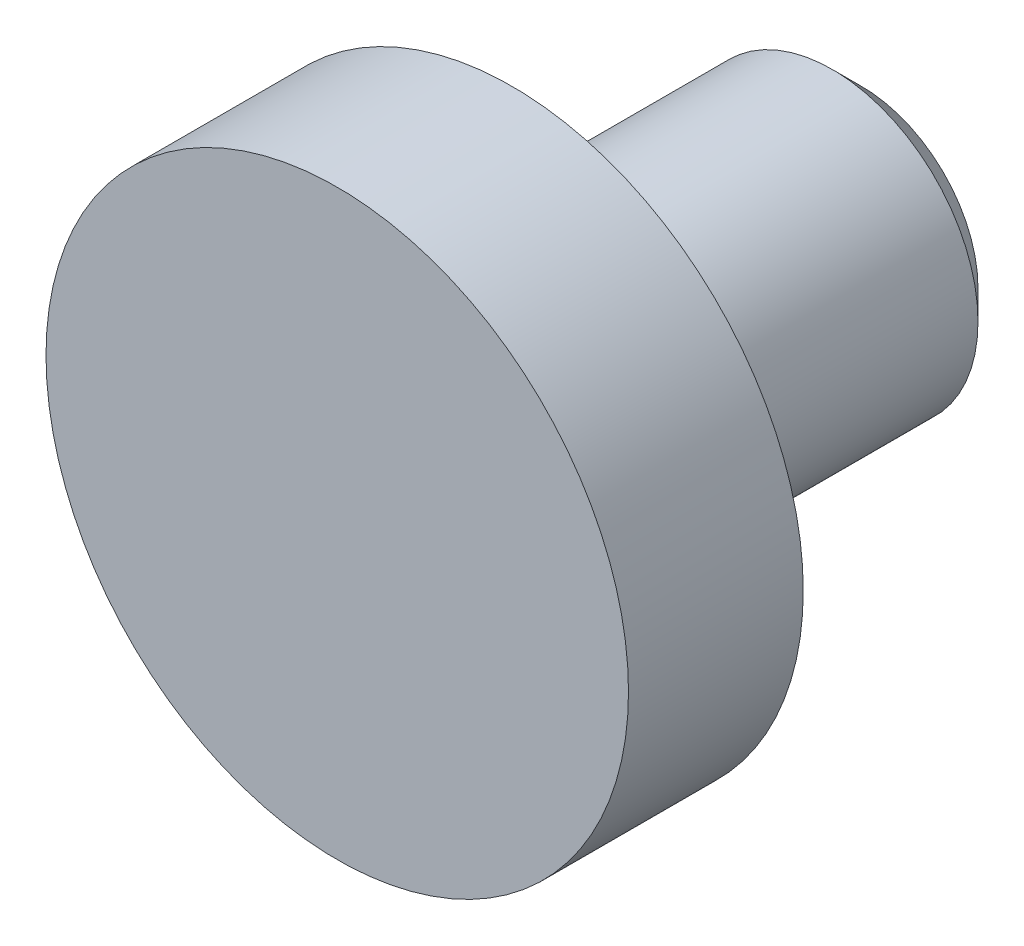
ISO-10303-21;
HEADER;
FILE_DESCRIPTION(('STEP AP214'),'2;1');
FILE_NAME('part.step','',(''),(''),'','','');
FILE_SCHEMA(('AUTOMOTIVE_DESIGN { 1 0 10303 214 1 1 1 1 }'));
ENDSEC;
DATA;
#1=APPLICATION_CONTEXT('core data for automotive mechanical design processes');
#2=APPLICATION_PROTOCOL_DEFINITION('international standard','automotive_design',2000,#1);
#3=PRODUCT_CONTEXT('',#1,'mechanical');
#4=PRODUCT('Part','Part','',(#3));
#5=PRODUCT_RELATED_PRODUCT_CATEGORY('part','',(#4));
#6=PRODUCT_DEFINITION_FORMATION('','',#4);
#7=PRODUCT_DEFINITION_CONTEXT('part definition',#1,'design');
#8=PRODUCT_DEFINITION('design','',#6,#7);
#9=PRODUCT_DEFINITION_SHAPE('','',#8);
#10=(LENGTH_UNIT() NAMED_UNIT(*) SI_UNIT(.MILLI.,.METRE.));
#11=(NAMED_UNIT(*) PLANE_ANGLE_UNIT() SI_UNIT($,.RADIAN.));
#12=(NAMED_UNIT(*) SI_UNIT($,.STERADIAN.) SOLID_ANGLE_UNIT());
#13=UNCERTAINTY_MEASURE_WITH_UNIT(LENGTH_MEASURE(1.E-05),#10,'distance_accuracy_value','');
#14=(GEOMETRIC_REPRESENTATION_CONTEXT(3) GLOBAL_UNCERTAINTY_ASSIGNED_CONTEXT((#13)) GLOBAL_UNIT_ASSIGNED_CONTEXT((#10,
#11,#12)) REPRESENTATION_CONTEXT('',''));
#15=CARTESIAN_POINT('',(0.,0.,0.));
#16=DIRECTION('',(0.,0.,1.));
#17=DIRECTION('',(1.,0.,0.));
#18=AXIS2_PLACEMENT_3D('',#15,#16,#17);
#19=CARTESIAN_POINT('',(0.,0.,6.));
#20=DIRECTION('',(0.,0.,-1.));
#21=DIRECTION('',(-1.,0.,0.));
#22=AXIS2_PLACEMENT_3D('',#19,#20,#21);
#23=CYLINDRICAL_SURFACE('',#22,2.5);
#24=CARTESIAN_POINT('',(0.,0.,0.500000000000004));
#25=DIRECTION('',(0.,0.,1.));
#26=DIRECTION('',(1.,0.,0.));
#27=AXIS2_PLACEMENT_3D('',#24,#25,#26);
#28=CIRCLE('',#27,2.5);
#29=CARTESIAN_POINT('',(2.5,0.,0.500000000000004));
#30=VERTEX_POINT('',#29);
#31=EDGE_CURVE('E45',#30,#30,#28,.T.);
#32=ORIENTED_EDGE('',*,*,#31,.T.);
#33=EDGE_LOOP('',(#32));
#34=FACE_BOUND('',#33,.T.);
#35=CARTESIAN_POINT('',(0.,0.,6.));
#36=DIRECTION('',(0.,0.,1.));
#37=DIRECTION('',(1.,0.,0.));
#38=AXIS2_PLACEMENT_3D('',#35,#36,#37);
#39=CIRCLE('',#38,2.5);
#40=CARTESIAN_POINT('',(2.5,0.,6.));
#41=VERTEX_POINT('',#40);
#42=EDGE_CURVE('E49',#41,#41,#39,.T.);
#43=ORIENTED_EDGE('',*,*,#42,.F.);
#44=EDGE_LOOP('',(#43));
#45=FACE_BOUND('',#44,.T.);
#46=ADVANCED_FACE('F37',(#34,#45),#23,.T.);
#47=CARTESIAN_POINT('',(0.,0.,0.));
#48=DIRECTION('',(0.,0.,1.));
#49=DIRECTION('',(1.,0.,0.));
#50=AXIS2_PLACEMENT_3D('',#47,#48,#49);
#51=PLANE('',#50);
#52=CARTESIAN_POINT('',(0.,0.,0.));
#53=DIRECTION('',(0.,0.,1.));
#54=DIRECTION('',(1.,0.,0.));
#55=AXIS2_PLACEMENT_3D('',#52,#53,#54);
#56=CIRCLE('',#55,2.);
#57=CARTESIAN_POINT('',(2.,0.,0.));
#58=VERTEX_POINT('',#57);
#59=EDGE_CURVE('E10',#58,#58,#56,.F.);
#60=ORIENTED_EDGE('',*,*,#59,.T.);
#61=EDGE_LOOP('',(#60));
#62=FACE_BOUND('',#61,.T.);
#63=ADVANCED_FACE('F67',(#62),#51,.F.);
#64=CARTESIAN_POINT('',(0.,0.,9.));
#65=DIRECTION('',(0.,0.,-1.));
#66=DIRECTION('',(-1.,0.,0.));
#67=AXIS2_PLACEMENT_3D('',#64,#65,#66);
#68=CYLINDRICAL_SURFACE('',#67,5.);
#69=CARTESIAN_POINT('',(0.,0.,9.));
#70=DIRECTION('',(0.,0.,1.));
#71=DIRECTION('',(1.,0.,0.));
#72=AXIS2_PLACEMENT_3D('',#69,#70,#71);
#73=CIRCLE('',#72,5.);
#74=CARTESIAN_POINT('',(5.,0.,9.));
#75=VERTEX_POINT('',#74);
#76=EDGE_CURVE('E53',#75,#75,#73,.T.);
#77=ORIENTED_EDGE('',*,*,#76,.F.);
#78=EDGE_LOOP('',(#77));
#79=FACE_BOUND('',#78,.T.);
#80=CARTESIAN_POINT('',(0.,0.,6.));
#81=DIRECTION('',(0.,0.,1.));
#82=DIRECTION('',(1.,0.,0.));
#83=AXIS2_PLACEMENT_3D('',#80,#81,#82);
#84=CIRCLE('',#83,5.);
#85=CARTESIAN_POINT('',(5.,0.,6.));
#86=VERTEX_POINT('',#85);
#87=EDGE_CURVE('E56',#86,#86,#84,.T.);
#88=ORIENTED_EDGE('',*,*,#87,.T.);
#89=EDGE_LOOP('',(#88));
#90=FACE_BOUND('',#89,.T.);
#91=ADVANCED_FACE('F64',(#79,#90),#68,.T.);
#92=CARTESIAN_POINT('',(0.,0.,9.));
#93=DIRECTION('',(0.,0.,1.));
#94=DIRECTION('',(1.,0.,0.));
#95=AXIS2_PLACEMENT_3D('',#92,#93,#94);
#96=PLANE('',#95);
#97=ORIENTED_EDGE('',*,*,#76,.T.);
#98=EDGE_LOOP('',(#97));
#99=FACE_BOUND('',#98,.T.);
#100=ADVANCED_FACE('F62',(#99),#96,.T.);
#101=CARTESIAN_POINT('',(0.,0.,6.));
#102=DIRECTION('',(0.,0.,1.));
#103=DIRECTION('',(1.,0.,0.));
#104=AXIS2_PLACEMENT_3D('',#101,#102,#103);
#105=PLANE('',#104);
#106=ORIENTED_EDGE('',*,*,#42,.T.);
#107=EDGE_LOOP('',(#106));
#108=FACE_BOUND('',#107,.T.);
#109=ORIENTED_EDGE('',*,*,#87,.F.);
#110=EDGE_LOOP('',(#109));
#111=FACE_BOUND('',#110,.T.);
#112=ADVANCED_FACE('F71',(#108,#111),#105,.F.);
#113=CARTESIAN_POINT('',(0.,0.,0.500000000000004));
#114=DIRECTION('',(0.,0.,1.));
#115=DIRECTION('',(1.,0.,0.));
#116=AXIS2_PLACEMENT_3D('',#113,#114,#115);
#117=CONICAL_SURFACE('',#116,2.5,0.785398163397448);
#118=ORIENTED_EDGE('',*,*,#59,.F.);
#119=EDGE_LOOP('',(#118));
#120=FACE_BOUND('',#119,.T.);
#121=ORIENTED_EDGE('',*,*,#31,.F.);
#122=EDGE_LOOP('',(#121));
#123=FACE_BOUND('',#122,.T.);
#124=ADVANCED_FACE('F40',(#120,#123),#117,.T.);
#125=CLOSED_SHELL('',(#46,#63,#91,#100,#112,#124));
#126=MANIFOLD_SOLID_BREP('B2',#125);
#127=ADVANCED_BREP_SHAPE_REPRESENTATION('',(#18,#126),#14);
#128=SHAPE_DEFINITION_REPRESENTATION(#9,#127);
ENDSEC;
END-ISO-10303-21;
